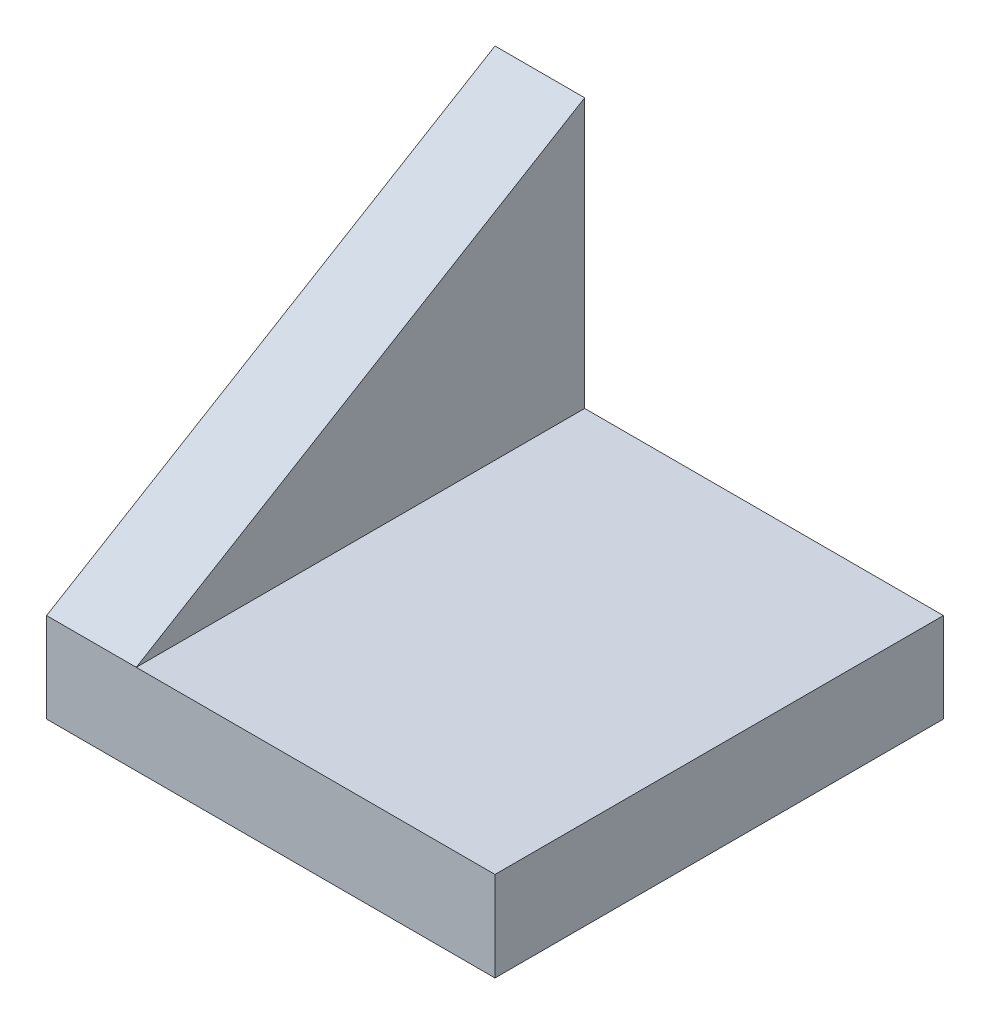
from build123d import *

# Parameters (mm, degrees)
SKETCH4_W           = 50
SKETCH4_H           = 50
BOSS_EXTRUDE1_DEPTH = 10
BOSS_EXTRUDE2_DEPTH = 10


with BuildPart() as part:
    # Sketch4 → Boss-Extrude1 (new body)
    with BuildSketch(Plane(origin=(0, 0, 0), x_dir=(1, 0, 0), z_dir=(0, 1, 0))):
        with Locations((-0.945378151, -6.722689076)):
            Rectangle(SKETCH4_W, SKETCH4_H)
    extrude(amount=BOSS_EXTRUDE1_DEPTH)

    # Sketch6 → Boss-Extrude2 (add)
    with BuildSketch(Plane.ZY.offset(25.945378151)):
        Polygon((-18.277310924, 10), (-18.277310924, 40), (31.722689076, 10), align=None)
    extrude(amount=-BOSS_EXTRUDE2_DEPTH)


solid = part.part
